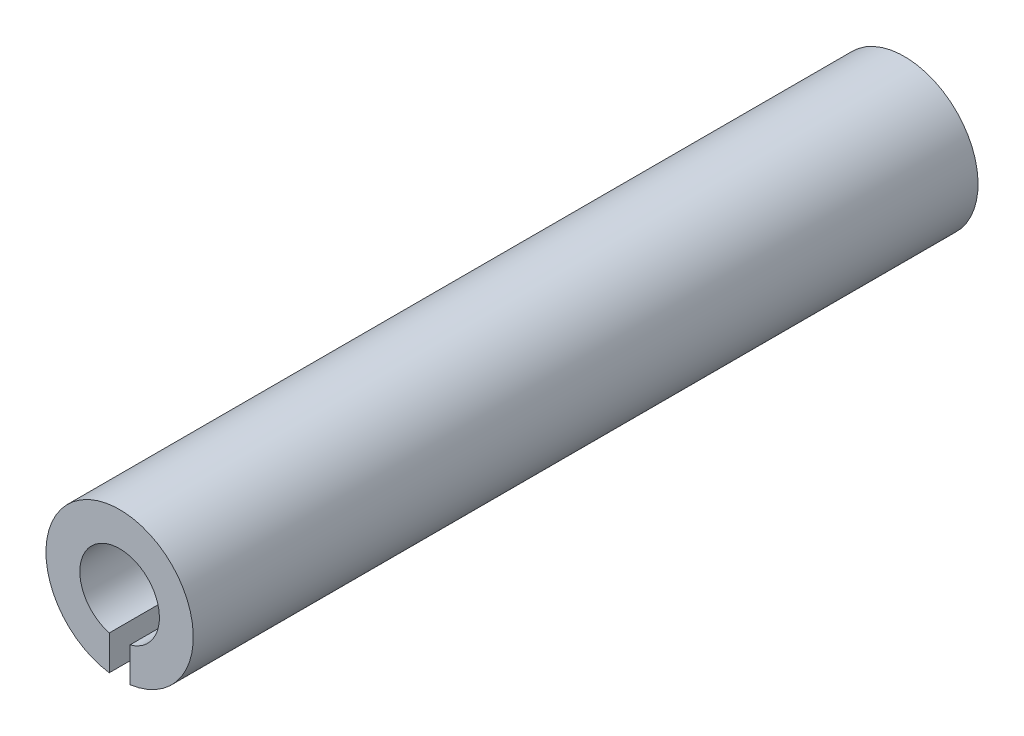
from build123d import *

# Parameters (mm, degrees)
BOSS_EXTRUDE1_DEPTH = 9.47


with BuildPart() as part:
    # Sketch1 → Boss-Extrude1 (new body)
    with BuildSketch(Plane.XY):
        with BuildLine():
            Line((-0.125, -0.880168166), (-0.125, -0.463438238))
            ThreePointArc((-0.125, -0.463438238), (-0.29189039, 0.381051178), (0.48, 0))
            ThreePointArc((0.48, 0), (0.381051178, -0.29189039), (0.125, -0.463438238))
            Line((0.125, -0.463438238), (0.125, -0.880168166))
            ThreePointArc((0.125, -0.880168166), (0.671359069, -0.582750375), (0.889, 0))
            ThreePointArc((0.889, 0), (-0.582750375, 0.671359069), (-0.125, -0.880168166))
        make_face()
    extrude(amount=-BOSS_EXTRUDE1_DEPTH)


solid = part.part
